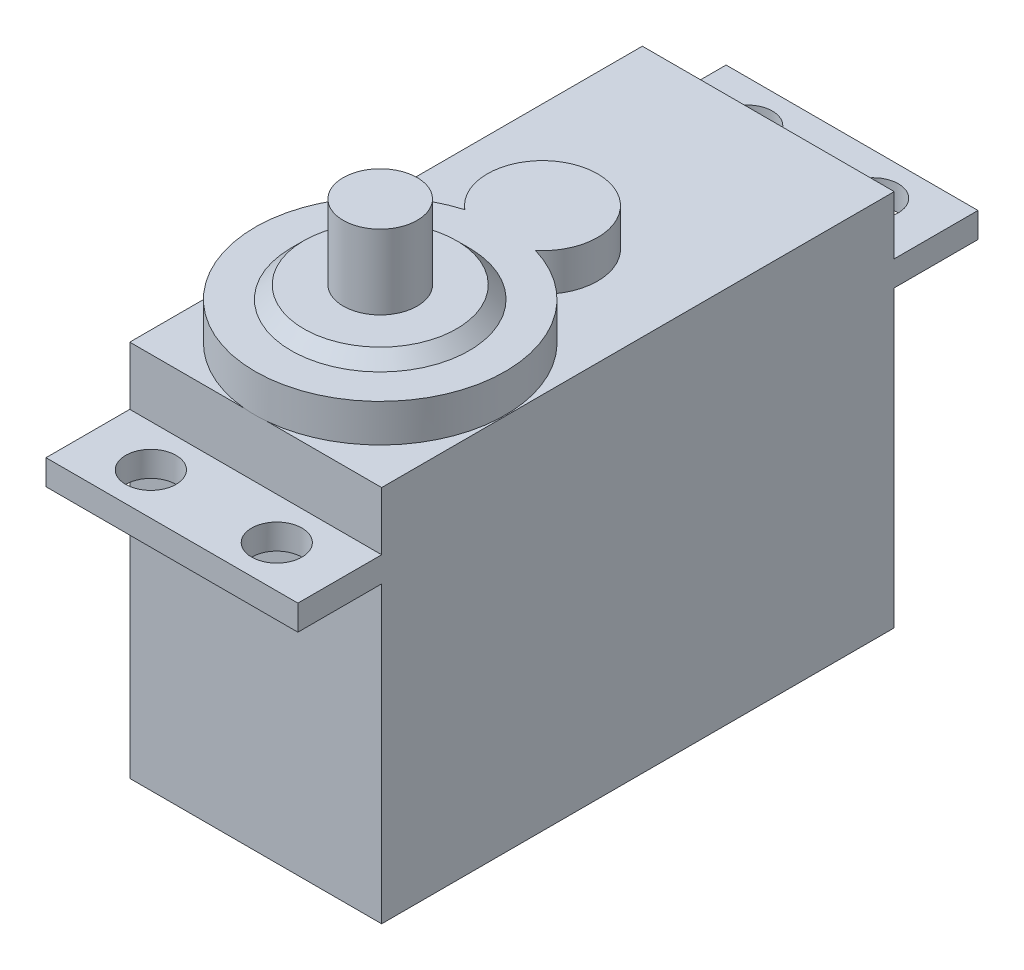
ISO-10303-21;
HEADER;
FILE_DESCRIPTION(('STEP AP214'),'2;1');
FILE_NAME('part.step','',(''),(''),'','','');
FILE_SCHEMA(('AUTOMOTIVE_DESIGN { 1 0 10303 214 1 1 1 1 }'));
ENDSEC;
DATA;
#1=APPLICATION_CONTEXT('core data for automotive mechanical design processes');
#2=APPLICATION_PROTOCOL_DEFINITION('international standard','automotive_design',2000,#1);
#3=PRODUCT_CONTEXT('',#1,'mechanical');
#4=PRODUCT('Part','Part','',(#3));
#5=PRODUCT_RELATED_PRODUCT_CATEGORY('part','',(#4));
#6=PRODUCT_DEFINITION_FORMATION('','',#4);
#7=PRODUCT_DEFINITION_CONTEXT('part definition',#1,'design');
#8=PRODUCT_DEFINITION('design','',#6,#7);
#9=PRODUCT_DEFINITION_SHAPE('','',#8);
#10=(LENGTH_UNIT() NAMED_UNIT(*) SI_UNIT(.MILLI.,.METRE.));
#11=(NAMED_UNIT(*) PLANE_ANGLE_UNIT() SI_UNIT($,.RADIAN.));
#12=(NAMED_UNIT(*) SI_UNIT($,.STERADIAN.) SOLID_ANGLE_UNIT());
#13=UNCERTAINTY_MEASURE_WITH_UNIT(LENGTH_MEASURE(1.E-05),#10,'distance_accuracy_value','');
#14=(GEOMETRIC_REPRESENTATION_CONTEXT(3) GLOBAL_UNCERTAINTY_ASSIGNED_CONTEXT((#13)) GLOBAL_UNIT_ASSIGNED_CONTEXT((#10,
#11,#12)) REPRESENTATION_CONTEXT('',''));
#15=CARTESIAN_POINT('',(0.,0.,0.));
#16=DIRECTION('',(0.,0.,1.));
#17=DIRECTION('',(1.,0.,0.));
#18=AXIS2_PLACEMENT_3D('',#15,#16,#17);
#19=CARTESIAN_POINT('',(-10.,15.,27.));
#20=DIRECTION('',(0.,0.,1.));
#21=DIRECTION('',(0.,-1.,0.));
#22=AXIS2_PLACEMENT_3D('',#19,#20,#21);
#23=PLANE('',#22);
#24=DIRECTION('',(-1.,0.,0.));
#25=VECTOR('',#24,1.);
#26=CARTESIAN_POINT('',(10.,8.37847971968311,27.));
#27=LINE('',#26,#25);
#28=CARTESIAN_POINT('',(10.,8.37847971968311,27.));
#29=VERTEX_POINT('',#28);
#30=CARTESIAN_POINT('',(-9.99999999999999,8.37847971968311,27.));
#31=VERTEX_POINT('',#30);
#32=EDGE_CURVE('E171',#29,#31,#27,.T.);
#33=ORIENTED_EDGE('',*,*,#32,.F.);
#34=DIRECTION('',(0.,-1.,0.));
#35=VECTOR('',#34,1.);
#36=CARTESIAN_POINT('',(9.99999999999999,15.,27.));
#37=LINE('',#36,#35);
#38=CARTESIAN_POINT('',(10.,10.3784797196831,27.));
#39=VERTEX_POINT('',#38);
#40=EDGE_CURVE('E162',#39,#29,#37,.T.);
#41=ORIENTED_EDGE('',*,*,#40,.F.);
#42=DIRECTION('',(-1.,0.,0.));
#43=VECTOR('',#42,1.);
#44=CARTESIAN_POINT('',(10.,10.3784797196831,27.));
#45=LINE('',#44,#43);
#46=CARTESIAN_POINT('',(-9.99999999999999,10.3784797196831,27.));
#47=VERTEX_POINT('',#46);
#48=EDGE_CURVE('E234',#39,#47,#45,.T.);
#49=ORIENTED_EDGE('',*,*,#48,.T.);
#50=DIRECTION('',(0.,-1.,0.));
#51=VECTOR('',#50,1.);
#52=CARTESIAN_POINT('',(-10.,15.,27.));
#53=LINE('',#52,#51);
#54=EDGE_CURVE('E243',#47,#31,#53,.T.);
#55=ORIENTED_EDGE('',*,*,#54,.T.);
#56=EDGE_LOOP('',(#33,#41,#49,#55));
#57=FACE_BOUND('',#56,.T.);
#58=ADVANCED_FACE('F33',(#57),#23,.T.);
#59=CARTESIAN_POINT('',(-10.,15.,-27.));
#60=DIRECTION('',(0.,1.,0.));
#61=DIRECTION('',(0.,0.,1.));
#62=AXIS2_PLACEMENT_3D('',#59,#60,#61);
#63=PLANE('',#62);
#64=DIRECTION('',(-1.,0.,0.));
#65=VECTOR('',#64,1.);
#66=CARTESIAN_POINT('',(10.,15.,-20.35));
#67=LINE('',#66,#65);
#68=CARTESIAN_POINT('',(9.99999999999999,15.,-20.35));
#69=VERTEX_POINT('',#68);
#70=CARTESIAN_POINT('',(-10.,15.,-20.35));
#71=VERTEX_POINT('',#70);
#72=EDGE_CURVE('E59',#69,#71,#67,.T.);
#73=ORIENTED_EDGE('',*,*,#72,.T.);
#74=DIRECTION('',(0.,0.,1.));
#75=VECTOR('',#74,1.);
#76=CARTESIAN_POINT('',(-10.,15.,-27.));
#77=LINE('',#76,#75);
#78=CARTESIAN_POINT('',(-9.99999999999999,15.,20.35));
#79=VERTEX_POINT('',#78);
#80=EDGE_CURVE('E41',#71,#79,#77,.T.);
#81=ORIENTED_EDGE('',*,*,#80,.T.);
#82=DIRECTION('',(-1.,0.,0.));
#83=VECTOR('',#82,1.);
#84=CARTESIAN_POINT('',(10.,15.,20.35));
#85=LINE('',#84,#83);
#86=CARTESIAN_POINT('',(-0.908630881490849,15.,20.35));
#87=VERTEX_POINT('',#86);
#88=EDGE_CURVE('E230',#87,#79,#85,.T.);
#89=ORIENTED_EDGE('',*,*,#88,.F.);
#90=CARTESIAN_POINT('',(2.7086923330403E-08,15.,10.4637902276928));
#91=DIRECTION('',(0.,1.,0.));
#92=DIRECTION('',(0.,0.,-1.));
#93=AXIS2_PLACEMENT_3D('',#90,#91,#92);
#94=CIRCLE('',#93,9.92787760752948);
#95=CARTESIAN_POINT('',(-2.80646396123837,15.,0.940843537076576));
#96=VERTEX_POINT('',#95);
#97=EDGE_CURVE('E43',#96,#87,#94,.T.);
#98=ORIENTED_EDGE('',*,*,#97,.F.);
#99=CARTESIAN_POINT('',(0.,15.,-2.42044969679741));
#100=DIRECTION('',(0.,1.,0.));
#101=DIRECTION('',(0.,0.,-1.));
#102=AXIS2_PLACEMENT_3D('',#99,#100,#101);
#103=CIRCLE('',#102,4.37887339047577);
#104=CARTESIAN_POINT('',(2.80646397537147,15.,0.940843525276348));
#105=VERTEX_POINT('',#104);
#106=EDGE_CURVE('E212',#105,#96,#103,.T.);
#107=ORIENTED_EDGE('',*,*,#106,.F.);
#108=CARTESIAN_POINT('',(0.9086309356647,15.,20.35));
#109=VERTEX_POINT('',#108);
#110=EDGE_CURVE('E11',#109,#105,#94,.T.);
#111=ORIENTED_EDGE('',*,*,#110,.F.);
#112=CARTESIAN_POINT('',(10.,15.,20.35));
#113=VERTEX_POINT('',#112);
#114=EDGE_CURVE('E239',#113,#109,#85,.T.);
#115=ORIENTED_EDGE('',*,*,#114,.F.);
#116=DIRECTION('',(0.,0.,1.));
#117=VECTOR('',#116,1.);
#118=CARTESIAN_POINT('',(9.99999999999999,15.,-27.));
#119=LINE('',#118,#117);
#120=EDGE_CURVE('E36',#69,#113,#119,.T.);
#121=ORIENTED_EDGE('',*,*,#120,.F.);
#122=EDGE_LOOP('',(#73,#81,#89,#98,#107,#111,#115,#121));
#123=FACE_BOUND('',#122,.T.);
#124=ADVANCED_FACE('F266',(#123),#63,.T.);
#125=CARTESIAN_POINT('',(-10.,-15.,-27.));
#126=DIRECTION('',(0.,0.,-1.));
#127=DIRECTION('',(-1.,0.,0.));
#128=AXIS2_PLACEMENT_3D('',#125,#126,#127);
#129=PLANE('',#128);
#130=DIRECTION('',(-1.,0.,0.));
#131=VECTOR('',#130,1.);
#132=CARTESIAN_POINT('',(10.,10.3784797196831,-27.));
#133=LINE('',#132,#131);
#134=CARTESIAN_POINT('',(10.,10.3784797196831,-27.));
#135=VERTEX_POINT('',#134);
#136=CARTESIAN_POINT('',(-10.,10.3784797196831,-27.));
#137=VERTEX_POINT('',#136);
#138=EDGE_CURVE('E185',#135,#137,#133,.T.);
#139=ORIENTED_EDGE('',*,*,#138,.F.);
#140=DIRECTION('',(0.,1.,0.));
#141=VECTOR('',#140,1.);
#142=CARTESIAN_POINT('',(9.99999999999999,-15.,-27.));
#143=LINE('',#142,#141);
#144=CARTESIAN_POINT('',(10.,8.37847971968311,-27.));
#145=VERTEX_POINT('',#144);
#146=EDGE_CURVE('E254',#145,#135,#143,.T.);
#147=ORIENTED_EDGE('',*,*,#146,.F.);
#148=DIRECTION('',(-1.,0.,0.));
#149=VECTOR('',#148,1.);
#150=CARTESIAN_POINT('',(10.,8.37847971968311,-27.));
#151=LINE('',#150,#149);
#152=CARTESIAN_POINT('',(-10.,8.37847971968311,-27.));
#153=VERTEX_POINT('',#152);
#154=EDGE_CURVE('E201',#145,#153,#151,.T.);
#155=ORIENTED_EDGE('',*,*,#154,.T.);
#156=DIRECTION('',(0.,1.,0.));
#157=VECTOR('',#156,1.);
#158=CARTESIAN_POINT('',(-10.,-15.,-27.));
#159=LINE('',#158,#157);
#160=EDGE_CURVE('E248',#153,#137,#159,.T.);
#161=ORIENTED_EDGE('',*,*,#160,.T.);
#162=EDGE_LOOP('',(#139,#147,#155,#161));
#163=FACE_BOUND('',#162,.T.);
#164=ADVANCED_FACE('F299',(#163),#129,.T.);
#165=CARTESIAN_POINT('',(-10.,-15.,27.));
#166=DIRECTION('',(0.,-1.,0.));
#167=DIRECTION('',(0.,0.,-1.));
#168=AXIS2_PLACEMENT_3D('',#165,#166,#167);
#169=PLANE('',#168);
#170=DIRECTION('',(-1.,0.,0.));
#171=VECTOR('',#170,1.);
#172=CARTESIAN_POINT('',(10.,-15.,20.35));
#173=LINE('',#172,#171);
#174=CARTESIAN_POINT('',(9.99999999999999,-15.,20.35));
#175=VERTEX_POINT('',#174);
#176=CARTESIAN_POINT('',(-9.99999999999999,-15.,20.35));
#177=VERTEX_POINT('',#176);
#178=EDGE_CURVE('E51',#175,#177,#173,.T.);
#179=ORIENTED_EDGE('',*,*,#178,.T.);
#180=DIRECTION('',(0.,0.,-1.));
#181=VECTOR('',#180,1.);
#182=CARTESIAN_POINT('',(-10.,-15.,27.));
#183=LINE('',#182,#181);
#184=CARTESIAN_POINT('',(-10.,-15.,-20.35));
#185=VERTEX_POINT('',#184);
#186=EDGE_CURVE('E246',#177,#185,#183,.T.);
#187=ORIENTED_EDGE('',*,*,#186,.T.);
#188=DIRECTION('',(-1.,0.,0.));
#189=VECTOR('',#188,1.);
#190=CARTESIAN_POINT('',(10.,-15.,-20.35));
#191=LINE('',#190,#189);
#192=CARTESIAN_POINT('',(10.,-15.,-20.35));
#193=VERTEX_POINT('',#192);
#194=EDGE_CURVE('E197',#193,#185,#191,.T.);
#195=ORIENTED_EDGE('',*,*,#194,.F.);
#196=DIRECTION('',(0.,0.,-1.));
#197=VECTOR('',#196,1.);
#198=CARTESIAN_POINT('',(9.99999999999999,-15.,27.));
#199=LINE('',#198,#197);
#200=EDGE_CURVE('E253',#175,#193,#199,.T.);
#201=ORIENTED_EDGE('',*,*,#200,.F.);
#202=EDGE_LOOP('',(#179,#187,#195,#201));
#203=FACE_BOUND('',#202,.T.);
#204=ADVANCED_FACE('F308',(#203),#169,.T.);
#205=CARTESIAN_POINT('',(-10.,0.,0.));
#206=DIRECTION('',(1.,0.,0.));
#207=DIRECTION('',(0.,0.,-1.));
#208=AXIS2_PLACEMENT_3D('',#205,#206,#207);
#209=PLANE('',#208);
#210=DIRECTION('',(0.,-1.,0.));
#211=VECTOR('',#210,1.);
#212=CARTESIAN_POINT('',(-9.99999999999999,8.37847971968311,20.35));
#213=LINE('',#212,#211);
#214=CARTESIAN_POINT('',(-9.99999999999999,8.37847971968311,20.35));
#215=VERTEX_POINT('',#214);
#216=EDGE_CURVE('E163',#215,#177,#213,.T.);
#217=ORIENTED_EDGE('',*,*,#216,.F.);
#218=DIRECTION('',(0.,0.,-1.));
#219=VECTOR('',#218,1.);
#220=CARTESIAN_POINT('',(-9.99999999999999,8.37847971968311,27.));
#221=LINE('',#220,#219);
#222=EDGE_CURVE('E150',#31,#215,#221,.T.);
#223=ORIENTED_EDGE('',*,*,#222,.F.);
#224=ORIENTED_EDGE('',*,*,#54,.F.);
#225=DIRECTION('',(0.,0.,1.));
#226=VECTOR('',#225,1.);
#227=CARTESIAN_POINT('',(-9.99999999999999,10.3784797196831,20.35));
#228=LINE('',#227,#226);
#229=CARTESIAN_POINT('',(-9.99999999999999,10.3784797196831,20.35));
#230=VERTEX_POINT('',#229);
#231=EDGE_CURVE('E228',#230,#47,#228,.T.);
#232=ORIENTED_EDGE('',*,*,#231,.F.);
#233=DIRECTION('',(0.,-1.,0.));
#234=VECTOR('',#233,1.);
#235=CARTESIAN_POINT('',(-9.99999999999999,15.,20.35));
#236=LINE('',#235,#234);
#237=EDGE_CURVE('E223',#79,#230,#236,.T.);
#238=ORIENTED_EDGE('',*,*,#237,.F.);
#239=ORIENTED_EDGE('',*,*,#80,.F.);
#240=DIRECTION('',(0.,1.,0.));
#241=VECTOR('',#240,1.);
#242=CARTESIAN_POINT('',(-10.,10.3784797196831,-20.35));
#243=LINE('',#242,#241);
#244=CARTESIAN_POINT('',(-10.,10.3784797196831,-20.35));
#245=VERTEX_POINT('',#244);
#246=EDGE_CURVE('E179',#245,#71,#243,.T.);
#247=ORIENTED_EDGE('',*,*,#246,.F.);
#248=DIRECTION('',(0.,0.,1.));
#249=VECTOR('',#248,1.);
#250=CARTESIAN_POINT('',(-10.,10.3784797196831,-27.));
#251=LINE('',#250,#249);
#252=EDGE_CURVE('E173',#137,#245,#251,.T.);
#253=ORIENTED_EDGE('',*,*,#252,.F.);
#254=ORIENTED_EDGE('',*,*,#160,.F.);
#255=DIRECTION('',(0.,0.,-1.));
#256=VECTOR('',#255,1.);
#257=CARTESIAN_POINT('',(-10.,8.37847971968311,-20.35));
#258=LINE('',#257,#256);
#259=CARTESIAN_POINT('',(-10.,8.37847971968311,-20.35));
#260=VERTEX_POINT('',#259);
#261=EDGE_CURVE('E194',#260,#153,#258,.T.);
#262=ORIENTED_EDGE('',*,*,#261,.F.);
#263=DIRECTION('',(0.,1.,0.));
#264=VECTOR('',#263,1.);
#265=CARTESIAN_POINT('',(-10.,-15.,-20.35));
#266=LINE('',#265,#264);
#267=EDGE_CURVE('E187',#185,#260,#266,.T.);
#268=ORIENTED_EDGE('',*,*,#267,.F.);
#269=ORIENTED_EDGE('',*,*,#186,.F.);
#270=EDGE_LOOP('',(#217,#223,#224,#232,#238,#239,#247,#253,#254,#262,#268,#269));
#271=FACE_BOUND('',#270,.T.);
#272=ADVANCED_FACE('F303',(#271),#209,.F.);
#273=CARTESIAN_POINT('',(9.99999999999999,0.,0.));
#274=DIRECTION('',(1.,0.,0.));
#275=DIRECTION('',(0.,0.,-1.));
#276=AXIS2_PLACEMENT_3D('',#273,#274,#275);
#277=PLANE('',#276);
#278=DIRECTION('',(0.,0.,-1.));
#279=VECTOR('',#278,1.);
#280=CARTESIAN_POINT('',(10.,8.37847971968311,27.));
#281=LINE('',#280,#279);
#282=CARTESIAN_POINT('',(10.,8.37847971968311,20.35));
#283=VERTEX_POINT('',#282);
#284=EDGE_CURVE('E147',#29,#283,#281,.T.);
#285=ORIENTED_EDGE('',*,*,#284,.T.);
#286=DIRECTION('',(0.,-1.,0.));
#287=VECTOR('',#286,1.);
#288=CARTESIAN_POINT('',(10.,8.37847971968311,20.35));
#289=LINE('',#288,#287);
#290=EDGE_CURVE('E152',#283,#175,#289,.T.);
#291=ORIENTED_EDGE('',*,*,#290,.T.);
#292=ORIENTED_EDGE('',*,*,#200,.T.);
#293=DIRECTION('',(0.,1.,0.));
#294=VECTOR('',#293,1.);
#295=CARTESIAN_POINT('',(10.,-15.,-20.35));
#296=LINE('',#295,#294);
#297=CARTESIAN_POINT('',(9.99999999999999,8.37847971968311,-20.35));
#298=VERTEX_POINT('',#297);
#299=EDGE_CURVE('E190',#193,#298,#296,.T.);
#300=ORIENTED_EDGE('',*,*,#299,.T.);
#301=DIRECTION('',(0.,0.,-1.));
#302=VECTOR('',#301,1.);
#303=CARTESIAN_POINT('',(10.,8.37847971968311,-20.35));
#304=LINE('',#303,#302);
#305=EDGE_CURVE('E193',#298,#145,#304,.T.);
#306=ORIENTED_EDGE('',*,*,#305,.T.);
#307=ORIENTED_EDGE('',*,*,#146,.T.);
#308=DIRECTION('',(0.,0.,1.));
#309=VECTOR('',#308,1.);
#310=CARTESIAN_POINT('',(10.,10.3784797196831,-27.));
#311=LINE('',#310,#309);
#312=CARTESIAN_POINT('',(10.,10.3784797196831,-20.35));
#313=VERTEX_POINT('',#312);
#314=EDGE_CURVE('E175',#135,#313,#311,.T.);
#315=ORIENTED_EDGE('',*,*,#314,.T.);
#316=DIRECTION('',(0.,1.,0.));
#317=VECTOR('',#316,1.);
#318=CARTESIAN_POINT('',(10.,10.3784797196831,-20.35));
#319=LINE('',#318,#317);
#320=EDGE_CURVE('E178',#313,#69,#319,.T.);
#321=ORIENTED_EDGE('',*,*,#320,.T.);
#322=ORIENTED_EDGE('',*,*,#120,.T.);
#323=DIRECTION('',(0.,-1.,0.));
#324=VECTOR('',#323,1.);
#325=CARTESIAN_POINT('',(10.,15.,20.35));
#326=LINE('',#325,#324);
#327=CARTESIAN_POINT('',(9.99999999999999,10.3784797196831,20.35));
#328=VERTEX_POINT('',#327);
#329=EDGE_CURVE('E224',#113,#328,#326,.T.);
#330=ORIENTED_EDGE('',*,*,#329,.T.);
#331=DIRECTION('',(0.,0.,1.));
#332=VECTOR('',#331,1.);
#333=CARTESIAN_POINT('',(10.,10.3784797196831,20.35));
#334=LINE('',#333,#332);
#335=EDGE_CURVE('E227',#328,#39,#334,.T.);
#336=ORIENTED_EDGE('',*,*,#335,.T.);
#337=ORIENTED_EDGE('',*,*,#40,.T.);
#338=EDGE_LOOP('',(#285,#291,#292,#300,#306,#307,#315,#321,#322,#330,#336,#337));
#339=FACE_BOUND('',#338,.T.);
#340=ADVANCED_FACE('F159',(#339),#277,.T.);
#341=CARTESIAN_POINT('',(10.,10.3784797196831,20.35));
#342=DIRECTION('',(0.,-1.,0.));
#343=DIRECTION('',(1.,0.,0.));
#344=AXIS2_PLACEMENT_3D('',#341,#342,#343);
#345=PLANE('',#344);
#346=CARTESIAN_POINT('',(5.00000000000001,10.3784797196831,23.675));
#347=DIRECTION('',(0.,1.,0.));
#348=DIRECTION('',(0.,0.,1.));
#349=AXIS2_PLACEMENT_3D('',#346,#347,#348);
#350=CIRCLE('',#349,1.99999999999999);
#351=CARTESIAN_POINT('',(5.00000000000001,10.3784797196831,25.675));
#352=VERTEX_POINT('',#351);
#353=EDGE_CURVE('E369',#352,#352,#350,.T.);
#354=ORIENTED_EDGE('',*,*,#353,.F.);
#355=EDGE_LOOP('',(#354));
#356=FACE_BOUND('',#355,.T.);
#357=CARTESIAN_POINT('',(-5.00000000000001,10.3784797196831,23.675));
#358=DIRECTION('',(0.,1.,0.));
#359=DIRECTION('',(0.,0.,1.));
#360=AXIS2_PLACEMENT_3D('',#357,#358,#359);
#361=CIRCLE('',#360,1.99999999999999);
#362=CARTESIAN_POINT('',(-5.00000000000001,10.3784797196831,25.675));
#363=VERTEX_POINT('',#362);
#364=EDGE_CURVE('E363',#363,#363,#361,.T.);
#365=ORIENTED_EDGE('',*,*,#364,.F.);
#366=EDGE_LOOP('',(#365));
#367=FACE_BOUND('',#366,.T.);
#368=ORIENTED_EDGE('',*,*,#231,.T.);
#369=ORIENTED_EDGE('',*,*,#48,.F.);
#370=ORIENTED_EDGE('',*,*,#335,.F.);
#371=DIRECTION('',(-1.,0.,0.));
#372=VECTOR('',#371,1.);
#373=CARTESIAN_POINT('',(10.,10.3784797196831,20.35));
#374=LINE('',#373,#372);
#375=EDGE_CURVE('E237',#328,#230,#374,.T.);
#376=ORIENTED_EDGE('',*,*,#375,.T.);
#377=EDGE_LOOP('',(#368,#369,#370,#376));
#378=FACE_BOUND('',#377,.T.);
#379=ADVANCED_FACE('F290',(#356,#367,#378),#345,.F.);
#380=CARTESIAN_POINT('',(10.,15.,20.35));
#381=DIRECTION('',(0.,0.,-1.));
#382=DIRECTION('',(-1.,0.,0.));
#383=AXIS2_PLACEMENT_3D('',#380,#381,#382);
#384=PLANE('',#383);
#385=ORIENTED_EDGE('',*,*,#237,.T.);
#386=ORIENTED_EDGE('',*,*,#375,.F.);
#387=ORIENTED_EDGE('',*,*,#329,.F.);
#388=ORIENTED_EDGE('',*,*,#114,.T.);
#389=EDGE_CURVE('E242',#109,#87,#85,.T.);
#390=ORIENTED_EDGE('',*,*,#389,.T.);
#391=ORIENTED_EDGE('',*,*,#88,.T.);
#392=EDGE_LOOP('',(#385,#386,#387,#388,#390,#391));
#393=FACE_BOUND('',#392,.T.);
#394=ADVANCED_FACE('F263',(#393),#384,.F.);
#395=CARTESIAN_POINT('',(1.35434620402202E-08,15.,4.02167026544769));
#396=DIRECTION('',(0.,-1.,0.));
#397=DIRECTION('',(0.,0.,-1.));
#398=AXIS2_PLACEMENT_3D('',#395,#396,#397);
#399=PLANE('',#398);
#400=ORIENTED_EDGE('',*,*,#389,.F.);
#401=EDGE_CURVE('E44',#87,#109,#94,.T.);
#402=ORIENTED_EDGE('',*,*,#401,.F.);
#403=EDGE_LOOP('',(#400,#402));
#404=FACE_BOUND('',#403,.T.);
#405=ADVANCED_FACE('F282',(#404),#399,.T.);
#406=CARTESIAN_POINT('',(2.7086923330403E-08,18.,10.4637902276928));
#407=DIRECTION('',(0.,-1.,0.));
#408=DIRECTION('',(0.,0.,-1.));
#409=AXIS2_PLACEMENT_3D('',#406,#407,#408);
#410=CYLINDRICAL_SURFACE('',#409,9.92787760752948);
#411=ORIENTED_EDGE('',*,*,#97,.T.);
#412=ORIENTED_EDGE('',*,*,#401,.T.);
#413=ORIENTED_EDGE('',*,*,#110,.T.);
#414=DIRECTION('',(0.,-1.,0.));
#415=VECTOR('',#414,1.);
#416=CARTESIAN_POINT('',(2.80646397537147,18.,0.940843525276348));
#417=LINE('',#416,#415);
#418=CARTESIAN_POINT('',(2.80646397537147,18.,0.940843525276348));
#419=VERTEX_POINT('',#418);
#420=EDGE_CURVE('E220',#419,#105,#417,.T.);
#421=ORIENTED_EDGE('',*,*,#420,.F.);
#422=CARTESIAN_POINT('',(2.7086923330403E-08,18.,10.4637902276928));
#423=DIRECTION('',(0.,1.,0.));
#424=DIRECTION('',(0.,0.,-1.));
#425=AXIS2_PLACEMENT_3D('',#422,#423,#424);
#426=CIRCLE('',#425,9.92787760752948);
#427=CARTESIAN_POINT('',(-2.80646396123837,18.,0.940843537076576));
#428=VERTEX_POINT('',#427);
#429=EDGE_CURVE('E208',#428,#419,#426,.T.);
#430=ORIENTED_EDGE('',*,*,#429,.F.);
#431=DIRECTION('',(0.,-1.,0.));
#432=VECTOR('',#431,1.);
#433=CARTESIAN_POINT('',(-2.80646396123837,18.,0.940843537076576));
#434=LINE('',#433,#432);
#435=EDGE_CURVE('E213',#428,#96,#434,.T.);
#436=ORIENTED_EDGE('',*,*,#435,.T.);
#437=EDGE_LOOP('',(#411,#412,#413,#421,#430,#436));
#438=FACE_BOUND('',#437,.T.);
#439=ADVANCED_FACE('F270',(#438),#410,.T.);
#440=CARTESIAN_POINT('',(0.,18.,-2.42044969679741));
#441=DIRECTION('',(0.,-1.,0.));
#442=DIRECTION('',(0.,0.,-1.));
#443=AXIS2_PLACEMENT_3D('',#440,#441,#442);
#444=CYLINDRICAL_SURFACE('',#443,4.37887339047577);
#445=ORIENTED_EDGE('',*,*,#106,.T.);
#446=ORIENTED_EDGE('',*,*,#435,.F.);
#447=CARTESIAN_POINT('',(0.,18.,-2.42044969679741));
#448=DIRECTION('',(0.,1.,0.));
#449=DIRECTION('',(0.,0.,-1.));
#450=AXIS2_PLACEMENT_3D('',#447,#448,#449);
#451=CIRCLE('',#450,4.37887339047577);
#452=EDGE_CURVE('E211',#419,#428,#451,.T.);
#453=ORIENTED_EDGE('',*,*,#452,.F.);
#454=ORIENTED_EDGE('',*,*,#420,.T.);
#455=EDGE_LOOP('',(#445,#446,#453,#454));
#456=FACE_BOUND('',#455,.T.);
#457=ADVANCED_FACE('F274',(#456),#444,.T.);
#458=CARTESIAN_POINT('',(1.35434620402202E-08,18.,4.02167026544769));
#459=DIRECTION('',(0.,-1.,0.));
#460=DIRECTION('',(0.,0.,-1.));
#461=AXIS2_PLACEMENT_3D('',#458,#459,#460);
#462=PLANE('',#461);
#463=CARTESIAN_POINT('',(0.,18.,10.4637902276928));
#464=DIRECTION('',(0.,1.,0.));
#465=DIRECTION('',(-1.,0.,0.));
#466=AXIS2_PLACEMENT_3D('',#463,#464,#465);
#467=CIRCLE('',#466,7.06731679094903);
#468=CARTESIAN_POINT('',(-7.06731679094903,18.,10.4637902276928));
#469=VERTEX_POINT('',#468);
#470=EDGE_CURVE('E167',#469,#469,#467,.T.);
#471=ORIENTED_EDGE('',*,*,#470,.F.);
#472=EDGE_LOOP('',(#471));
#473=FACE_BOUND('',#472,.T.);
#474=ORIENTED_EDGE('',*,*,#429,.T.);
#475=ORIENTED_EDGE('',*,*,#452,.T.);
#476=EDGE_LOOP('',(#474,#475));
#477=FACE_BOUND('',#476,.T.);
#478=ADVANCED_FACE('F277',(#473,#477),#462,.F.);
#479=CARTESIAN_POINT('',(10.,8.37847971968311,-20.35));
#480=DIRECTION('',(0.,1.,0.));
#481=DIRECTION('',(-1.,0.,0.));
#482=AXIS2_PLACEMENT_3D('',#479,#480,#481);
#483=PLANE('',#482);
#484=CARTESIAN_POINT('',(-5.00000000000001,8.37847971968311,-23.675));
#485=DIRECTION('',(0.,1.,0.));
#486=DIRECTION('',(-1.,0.,0.));
#487=AXIS2_PLACEMENT_3D('',#484,#485,#486);
#488=CIRCLE('',#487,1.99999999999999);
#489=CARTESIAN_POINT('',(-7.,8.37847971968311,-23.675));
#490=VERTEX_POINT('',#489);
#491=EDGE_CURVE('E378',#490,#490,#488,.T.);
#492=ORIENTED_EDGE('',*,*,#491,.T.);
#493=EDGE_LOOP('',(#492));
#494=FACE_BOUND('',#493,.T.);
#495=CARTESIAN_POINT('',(5.00000000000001,8.37847971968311,-23.675));
#496=DIRECTION('',(0.,1.,0.));
#497=DIRECTION('',(-1.,0.,0.));
#498=AXIS2_PLACEMENT_3D('',#495,#496,#497);
#499=CIRCLE('',#498,1.99999999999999);
#500=CARTESIAN_POINT('',(3.00000000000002,8.37847971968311,-23.675));
#501=VERTEX_POINT('',#500);
#502=EDGE_CURVE('E372',#501,#501,#499,.T.);
#503=ORIENTED_EDGE('',*,*,#502,.T.);
#504=EDGE_LOOP('',(#503));
#505=FACE_BOUND('',#504,.T.);
#506=ORIENTED_EDGE('',*,*,#261,.T.);
#507=ORIENTED_EDGE('',*,*,#154,.F.);
#508=ORIENTED_EDGE('',*,*,#305,.F.);
#509=DIRECTION('',(-1.,0.,0.));
#510=VECTOR('',#509,1.);
#511=CARTESIAN_POINT('',(10.,8.37847971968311,-20.35));
#512=LINE('',#511,#510);
#513=EDGE_CURVE('E204',#298,#260,#512,.T.);
#514=ORIENTED_EDGE('',*,*,#513,.T.);
#515=EDGE_LOOP('',(#506,#507,#508,#514));
#516=FACE_BOUND('',#515,.T.);
#517=ADVANCED_FACE('F316',(#494,#505,#516),#483,.F.);
#518=CARTESIAN_POINT('',(10.,-15.,-20.35));
#519=DIRECTION('',(0.,0.,1.));
#520=DIRECTION('',(1.,0.,0.));
#521=AXIS2_PLACEMENT_3D('',#518,#519,#520);
#522=PLANE('',#521);
#523=ORIENTED_EDGE('',*,*,#267,.T.);
#524=ORIENTED_EDGE('',*,*,#513,.F.);
#525=ORIENTED_EDGE('',*,*,#299,.F.);
#526=ORIENTED_EDGE('',*,*,#194,.T.);
#527=EDGE_LOOP('',(#523,#524,#525,#526));
#528=FACE_BOUND('',#527,.T.);
#529=ADVANCED_FACE('F313',(#528),#522,.F.);
#530=CARTESIAN_POINT('',(10.,10.3784797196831,-27.));
#531=DIRECTION('',(0.,-1.,0.));
#532=DIRECTION('',(1.,0.,0.));
#533=AXIS2_PLACEMENT_3D('',#530,#531,#532);
#534=PLANE('',#533);
#535=CARTESIAN_POINT('',(-5.00000000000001,10.3784797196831,-23.675));
#536=DIRECTION('',(0.,1.,0.));
#537=DIRECTION('',(0.,0.,1.));
#538=AXIS2_PLACEMENT_3D('',#535,#536,#537);
#539=CIRCLE('',#538,1.99999999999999);
#540=CARTESIAN_POINT('',(-5.00000000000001,10.3784797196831,-21.675));
#541=VERTEX_POINT('',#540);
#542=EDGE_CURVE('E381',#541,#541,#539,.T.);
#543=ORIENTED_EDGE('',*,*,#542,.F.);
#544=EDGE_LOOP('',(#543));
#545=FACE_BOUND('',#544,.T.);
#546=CARTESIAN_POINT('',(5.00000000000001,10.3784797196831,-23.675));
#547=DIRECTION('',(0.,1.,0.));
#548=DIRECTION('',(0.,0.,1.));
#549=AXIS2_PLACEMENT_3D('',#546,#547,#548);
#550=CIRCLE('',#549,1.99999999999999);
#551=CARTESIAN_POINT('',(5.00000000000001,10.3784797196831,-21.675));
#552=VERTEX_POINT('',#551);
#553=EDGE_CURVE('E375',#552,#552,#550,.T.);
#554=ORIENTED_EDGE('',*,*,#553,.F.);
#555=EDGE_LOOP('',(#554));
#556=FACE_BOUND('',#555,.T.);
#557=ORIENTED_EDGE('',*,*,#252,.T.);
#558=DIRECTION('',(-1.,0.,0.));
#559=VECTOR('',#558,1.);
#560=CARTESIAN_POINT('',(10.,10.3784797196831,-20.35));
#561=LINE('',#560,#559);
#562=EDGE_CURVE('E181',#313,#245,#561,.T.);
#563=ORIENTED_EDGE('',*,*,#562,.F.);
#564=ORIENTED_EDGE('',*,*,#314,.F.);
#565=ORIENTED_EDGE('',*,*,#138,.T.);
#566=EDGE_LOOP('',(#557,#563,#564,#565));
#567=FACE_BOUND('',#566,.T.);
#568=ADVANCED_FACE('F322',(#545,#556,#567),#534,.F.);
#569=CARTESIAN_POINT('',(10.,10.3784797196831,-20.35));
#570=DIRECTION('',(0.,0.,1.));
#571=DIRECTION('',(1.,0.,0.));
#572=AXIS2_PLACEMENT_3D('',#569,#570,#571);
#573=PLANE('',#572);
#574=ORIENTED_EDGE('',*,*,#246,.T.);
#575=ORIENTED_EDGE('',*,*,#72,.F.);
#576=ORIENTED_EDGE('',*,*,#320,.F.);
#577=ORIENTED_EDGE('',*,*,#562,.T.);
#578=EDGE_LOOP('',(#574,#575,#576,#577));
#579=FACE_BOUND('',#578,.T.);
#580=ADVANCED_FACE('F324',(#579),#573,.F.);
#581=CARTESIAN_POINT('',(10.,8.37847971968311,27.));
#582=DIRECTION('',(0.,1.,0.));
#583=DIRECTION('',(-1.,0.,0.));
#584=AXIS2_PLACEMENT_3D('',#581,#582,#583);
#585=PLANE('',#584);
#586=CARTESIAN_POINT('',(5.00000000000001,8.37847971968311,23.675));
#587=DIRECTION('',(0.,1.,0.));
#588=DIRECTION('',(-1.,0.,0.));
#589=AXIS2_PLACEMENT_3D('',#586,#587,#588);
#590=CIRCLE('',#589,1.99999999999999);
#591=CARTESIAN_POINT('',(3.00000000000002,8.37847971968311,23.675));
#592=VERTEX_POINT('',#591);
#593=EDGE_CURVE('E366',#592,#592,#590,.T.);
#594=ORIENTED_EDGE('',*,*,#593,.T.);
#595=EDGE_LOOP('',(#594));
#596=FACE_BOUND('',#595,.T.);
#597=CARTESIAN_POINT('',(-5.00000000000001,8.37847971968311,23.675));
#598=DIRECTION('',(0.,1.,0.));
#599=DIRECTION('',(-1.,0.,0.));
#600=AXIS2_PLACEMENT_3D('',#597,#598,#599);
#601=CIRCLE('',#600,1.99999999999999);
#602=CARTESIAN_POINT('',(-7.,8.37847971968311,23.675));
#603=VERTEX_POINT('',#602);
#604=EDGE_CURVE('E360',#603,#603,#601,.T.);
#605=ORIENTED_EDGE('',*,*,#604,.T.);
#606=EDGE_LOOP('',(#605));
#607=FACE_BOUND('',#606,.T.);
#608=ORIENTED_EDGE('',*,*,#222,.T.);
#609=DIRECTION('',(-1.,0.,0.));
#610=VECTOR('',#609,1.);
#611=CARTESIAN_POINT('',(10.,8.37847971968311,20.35));
#612=LINE('',#611,#610);
#613=EDGE_CURVE('E144',#283,#215,#612,.T.);
#614=ORIENTED_EDGE('',*,*,#613,.F.);
#615=ORIENTED_EDGE('',*,*,#284,.F.);
#616=ORIENTED_EDGE('',*,*,#32,.T.);
#617=EDGE_LOOP('',(#608,#614,#615,#616));
#618=FACE_BOUND('',#617,.T.);
#619=ADVANCED_FACE('F145',(#596,#607,#618),#585,.F.);
#620=CARTESIAN_POINT('',(10.,8.37847971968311,20.35));
#621=DIRECTION('',(0.,0.,-1.));
#622=DIRECTION('',(-1.,0.,0.));
#623=AXIS2_PLACEMENT_3D('',#620,#621,#622);
#624=PLANE('',#623);
#625=ORIENTED_EDGE('',*,*,#216,.T.);
#626=ORIENTED_EDGE('',*,*,#178,.F.);
#627=ORIENTED_EDGE('',*,*,#290,.F.);
#628=ORIENTED_EDGE('',*,*,#613,.T.);
#629=EDGE_LOOP('',(#625,#626,#627,#628));
#630=FACE_BOUND('',#629,.T.);
#631=ADVANCED_FACE('F154',(#630),#624,.F.);
#632=CARTESIAN_POINT('',(0.,19.,10.4637902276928));
#633=DIRECTION('',(0.,-1.,0.));
#634=DIRECTION('',(1.,0.,0.));
#635=AXIS2_PLACEMENT_3D('',#632,#633,#634);
#636=CONICAL_SURFACE('',#635,6.067316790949,0.785398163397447);
#637=ORIENTED_EDGE('',*,*,#470,.T.);
#638=EDGE_LOOP('',(#637));
#639=FACE_BOUND('',#638,.T.);
#640=CARTESIAN_POINT('',(0.,19.,10.4637902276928));
#641=DIRECTION('',(0.,1.,0.));
#642=DIRECTION('',(-1.,0.,0.));
#643=AXIS2_PLACEMENT_3D('',#640,#641,#642);
#644=CIRCLE('',#643,6.067316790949);
#645=CARTESIAN_POINT('',(-6.067316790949,19.,10.4637902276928));
#646=VERTEX_POINT('',#645);
#647=EDGE_CURVE('E355',#646,#646,#644,.T.);
#648=ORIENTED_EDGE('',*,*,#647,.F.);
#649=EDGE_LOOP('',(#648));
#650=FACE_BOUND('',#649,.T.);
#651=ADVANCED_FACE('F420',(#639,#650),#636,.T.);
#652=CARTESIAN_POINT('',(0.,24.9,10.4637902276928));
#653=DIRECTION('',(0.,1.,0.));
#654=DIRECTION('',(-1.,0.,0.));
#655=AXIS2_PLACEMENT_3D('',#652,#653,#654);
#656=PLANE('',#655);
#657=CARTESIAN_POINT('',(0.,24.9,10.4637902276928));
#658=DIRECTION('',(0.,1.,0.));
#659=DIRECTION('',(-1.,0.,0.));
#660=AXIS2_PLACEMENT_3D('',#657,#658,#659);
#661=CIRCLE('',#660,2.9387118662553);
#662=CARTESIAN_POINT('',(-2.9387118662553,24.9,10.4637902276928));
#663=VERTEX_POINT('',#662);
#664=EDGE_CURVE('E349',#663,#663,#661,.T.);
#665=ORIENTED_EDGE('',*,*,#664,.T.);
#666=EDGE_LOOP('',(#665));
#667=FACE_BOUND('',#666,.T.);
#668=ADVANCED_FACE('F416',(#667),#656,.T.);
#669=CARTESIAN_POINT('',(0.,18.,10.4637902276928));
#670=DIRECTION('',(0.,1.,0.));
#671=DIRECTION('',(-1.,0.,0.));
#672=AXIS2_PLACEMENT_3D('',#669,#670,#671);
#673=CYLINDRICAL_SURFACE('',#672,2.9387118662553);
#674=CARTESIAN_POINT('',(0.,19.,10.4637902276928));
#675=DIRECTION('',(0.,1.,0.));
#676=DIRECTION('',(-1.,0.,0.));
#677=AXIS2_PLACEMENT_3D('',#674,#675,#676);
#678=CIRCLE('',#677,2.9387118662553);
#679=CARTESIAN_POINT('',(-2.9387118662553,19.,10.4637902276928));
#680=VERTEX_POINT('',#679);
#681=EDGE_CURVE('E351',#680,#680,#678,.T.);
#682=ORIENTED_EDGE('',*,*,#681,.T.);
#683=EDGE_LOOP('',(#682));
#684=FACE_BOUND('',#683,.T.);
#685=ORIENTED_EDGE('',*,*,#664,.F.);
#686=EDGE_LOOP('',(#685));
#687=FACE_BOUND('',#686,.T.);
#688=ADVANCED_FACE('F412',(#684,#687),#673,.T.);
#689=CARTESIAN_POINT('',(2.9387118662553,19.,10.4637902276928));
#690=DIRECTION('',(0.,1.,0.));
#691=DIRECTION('',(-1.,0.,0.));
#692=AXIS2_PLACEMENT_3D('',#689,#690,#691);
#693=PLANE('',#692);
#694=ORIENTED_EDGE('',*,*,#647,.T.);
#695=EDGE_LOOP('',(#694));
#696=FACE_BOUND('',#695,.T.);
#697=ORIENTED_EDGE('',*,*,#681,.F.);
#698=EDGE_LOOP('',(#697));
#699=FACE_BOUND('',#698,.T.);
#700=ADVANCED_FACE('F408',(#696,#699),#693,.T.);
#701=CARTESIAN_POINT('',(-5.00000000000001,10.3784797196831,23.675));
#702=DIRECTION('',(0.,1.,0.));
#703=DIRECTION('',(0.,0.,1.));
#704=AXIS2_PLACEMENT_3D('',#701,#702,#703);
#705=CYLINDRICAL_SURFACE('',#704,1.99999999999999);
#706=ORIENTED_EDGE('',*,*,#364,.T.);
#707=EDGE_LOOP('',(#706));
#708=FACE_BOUND('',#707,.T.);
#709=ORIENTED_EDGE('',*,*,#604,.F.);
#710=EDGE_LOOP('',(#709));
#711=FACE_BOUND('',#710,.T.);
#712=ADVANCED_FACE('F402',(#708,#711),#705,.F.);
#713=CARTESIAN_POINT('',(5.00000000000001,10.3784797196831,23.675));
#714=DIRECTION('',(0.,1.,0.));
#715=DIRECTION('',(0.,0.,1.));
#716=AXIS2_PLACEMENT_3D('',#713,#714,#715);
#717=CYLINDRICAL_SURFACE('',#716,1.99999999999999);
#718=ORIENTED_EDGE('',*,*,#353,.T.);
#719=EDGE_LOOP('',(#718));
#720=FACE_BOUND('',#719,.T.);
#721=ORIENTED_EDGE('',*,*,#593,.F.);
#722=EDGE_LOOP('',(#721));
#723=FACE_BOUND('',#722,.T.);
#724=ADVANCED_FACE('F393',(#720,#723),#717,.F.);
#725=CARTESIAN_POINT('',(5.00000000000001,10.3784797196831,-23.675));
#726=DIRECTION('',(0.,1.,0.));
#727=DIRECTION('',(0.,0.,1.));
#728=AXIS2_PLACEMENT_3D('',#725,#726,#727);
#729=CYLINDRICAL_SURFACE('',#728,1.99999999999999);
#730=ORIENTED_EDGE('',*,*,#553,.T.);
#731=EDGE_LOOP('',(#730));
#732=FACE_BOUND('',#731,.T.);
#733=ORIENTED_EDGE('',*,*,#502,.F.);
#734=EDGE_LOOP('',(#733));
#735=FACE_BOUND('',#734,.T.);
#736=ADVANCED_FACE('F390',(#732,#735),#729,.F.);
#737=CARTESIAN_POINT('',(-5.00000000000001,10.3784797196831,-23.675));
#738=DIRECTION('',(0.,1.,0.));
#739=DIRECTION('',(0.,0.,1.));
#740=AXIS2_PLACEMENT_3D('',#737,#738,#739);
#741=CYLINDRICAL_SURFACE('',#740,1.99999999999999);
#742=ORIENTED_EDGE('',*,*,#542,.T.);
#743=EDGE_LOOP('',(#742));
#744=FACE_BOUND('',#743,.T.);
#745=ORIENTED_EDGE('',*,*,#491,.F.);
#746=EDGE_LOOP('',(#745));
#747=FACE_BOUND('',#746,.T.);
#748=ADVANCED_FACE('F385',(#744,#747),#741,.F.);
#749=CLOSED_SHELL('',(#58,#124,#164,#204,#272,#340,#379,#394,#405,#439,#457,#478,#517,#529,#568,
#580,#619,#631,#651,#668,#688,#700,#712,#724,#736,#748));
#750=MANIFOLD_SOLID_BREP('B2',#749);
#751=ADVANCED_BREP_SHAPE_REPRESENTATION('',(#18,#750),#14);
#752=SHAPE_DEFINITION_REPRESENTATION(#9,#751);
ENDSEC;
END-ISO-10303-21;
